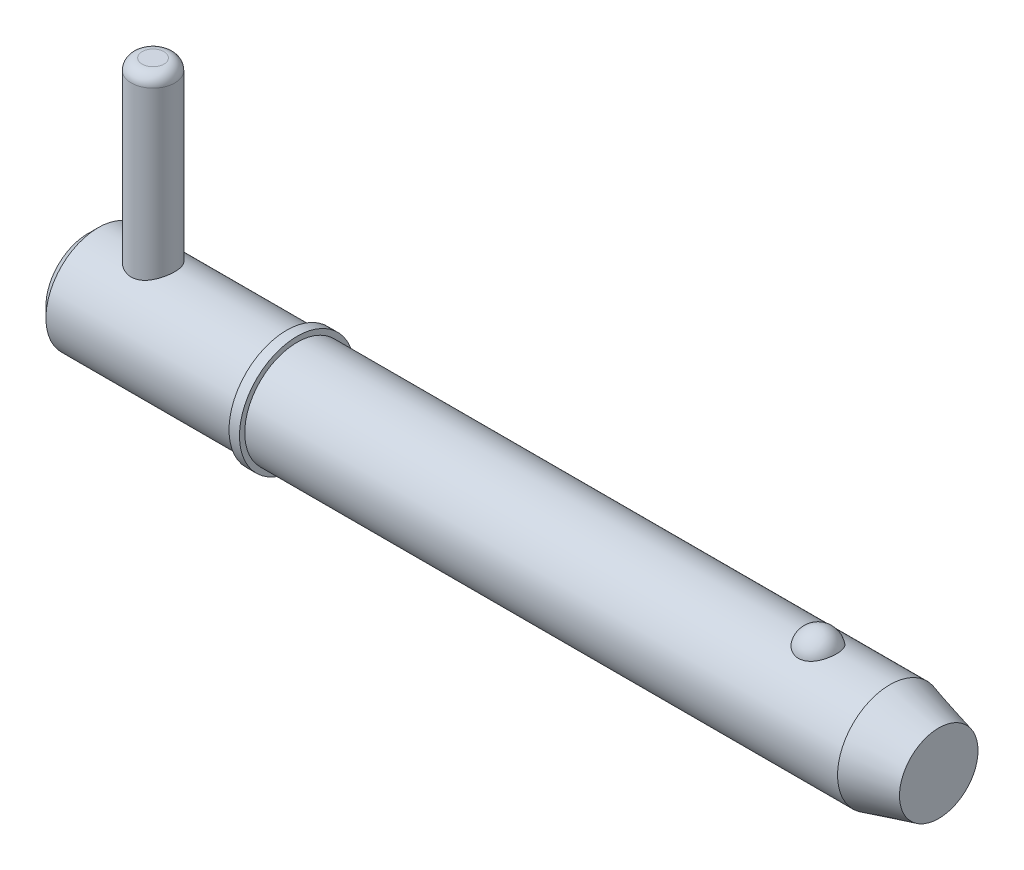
ISO-10303-21;
HEADER;
FILE_DESCRIPTION(('STEP AP214'),'2;1');
FILE_NAME('part.step','',(''),(''),'','','');
FILE_SCHEMA(('AUTOMOTIVE_DESIGN { 1 0 10303 214 1 1 1 1 }'));
ENDSEC;
DATA;
#1=APPLICATION_CONTEXT('core data for automotive mechanical design processes');
#2=APPLICATION_PROTOCOL_DEFINITION('international standard','automotive_design',2000,#1);
#3=PRODUCT_CONTEXT('',#1,'mechanical');
#4=PRODUCT('Part','Part','',(#3));
#5=PRODUCT_RELATED_PRODUCT_CATEGORY('part','',(#4));
#6=PRODUCT_DEFINITION_FORMATION('','',#4);
#7=PRODUCT_DEFINITION_CONTEXT('part definition',#1,'design');
#8=PRODUCT_DEFINITION('design','',#6,#7);
#9=PRODUCT_DEFINITION_SHAPE('','',#8);
#10=(LENGTH_UNIT() NAMED_UNIT(*) SI_UNIT(.MILLI.,.METRE.));
#11=(NAMED_UNIT(*) PLANE_ANGLE_UNIT() SI_UNIT($,.RADIAN.));
#12=(NAMED_UNIT(*) SI_UNIT($,.STERADIAN.) SOLID_ANGLE_UNIT());
#13=UNCERTAINTY_MEASURE_WITH_UNIT(LENGTH_MEASURE(1.E-05),#10,'distance_accuracy_value','');
#14=(GEOMETRIC_REPRESENTATION_CONTEXT(3) GLOBAL_UNCERTAINTY_ASSIGNED_CONTEXT((#13)) GLOBAL_UNIT_ASSIGNED_CONTEXT((#10,
#11,#12)) REPRESENTATION_CONTEXT('',''));
#15=CARTESIAN_POINT('',(0.,0.,0.));
#16=DIRECTION('',(0.,0.,1.));
#17=DIRECTION('',(1.,0.,0.));
#18=AXIS2_PLACEMENT_3D('',#15,#16,#17);
#19=CARTESIAN_POINT('',(5.94,20.635,0.));
#20=DIRECTION('',(0.,-1.,0.));
#21=DIRECTION('',(0.,0.,-1.));
#22=AXIS2_PLACEMENT_3D('',#19,#20,#21);
#23=CYLINDRICAL_SURFACE('',#22,1.98);
#24=CARTESIAN_POINT('',(5.94,-3.775,0.));
#25=DIRECTION('',(0.,1.,0.));
#26=DIRECTION('',(0.,0.,1.));
#27=AXIS2_PLACEMENT_3D('',#24,#25,#26);
#28=CIRCLE('',#27,1.98);
#29=CARTESIAN_POINT('',(5.94,-3.775,1.98));
#30=VERTEX_POINT('',#29);
#31=EDGE_CURVE('P0_E25',#30,#30,#28,.T.);
#32=ORIENTED_EDGE('',*,*,#31,.T.);
#33=EDGE_LOOP('',(#32));
#34=FACE_BOUND('',#33,.T.);
#35=CARTESIAN_POINT('',(5.94,19.645,0.));
#36=DIRECTION('',(0.,1.,0.));
#37=DIRECTION('',(0.,0.,1.));
#38=AXIS2_PLACEMENT_3D('',#35,#36,#37);
#39=CIRCLE('',#38,1.98);
#40=CARTESIAN_POINT('',(5.94,19.645,1.98));
#41=VERTEX_POINT('',#40);
#42=EDGE_CURVE('P0_E29',#41,#41,#39,.F.);
#43=ORIENTED_EDGE('',*,*,#42,.T.);
#44=EDGE_LOOP('',(#43));
#45=FACE_BOUND('',#44,.T.);
#46=ADVANCED_FACE('P0_F14',(#34,#45),#23,.T.);
#47=CARTESIAN_POINT('',(5.94,20.635,0.));
#48=DIRECTION('',(0.,1.,0.));
#49=DIRECTION('',(0.,0.,1.));
#50=AXIS2_PLACEMENT_3D('',#47,#48,#49);
#51=PLANE('',#50);
#52=CARTESIAN_POINT('',(5.94,20.635,0.));
#53=DIRECTION('',(0.,1.,0.));
#54=DIRECTION('',(0.,0.,1.));
#55=AXIS2_PLACEMENT_3D('',#52,#53,#54);
#56=CIRCLE('',#55,0.99);
#57=CARTESIAN_POINT('',(5.94,20.635,0.99));
#58=VERTEX_POINT('',#57);
#59=EDGE_CURVE('P0_E10',#58,#58,#56,.T.);
#60=ORIENTED_EDGE('',*,*,#59,.T.);
#61=EDGE_LOOP('',(#60));
#62=FACE_BOUND('',#61,.T.);
#63=ADVANCED_FACE('P0_F46',(#62),#51,.T.);
#64=CARTESIAN_POINT('',(5.94,-4.765,0.));
#65=DIRECTION('',(0.,1.,0.));
#66=DIRECTION('',(0.,0.,1.));
#67=AXIS2_PLACEMENT_3D('',#64,#65,#66);
#68=PLANE('',#67);
#69=CARTESIAN_POINT('',(5.94,-4.765,0.));
#70=DIRECTION('',(0.,1.,0.));
#71=DIRECTION('',(0.,0.,1.));
#72=AXIS2_PLACEMENT_3D('',#69,#70,#71);
#73=CIRCLE('',#72,0.99);
#74=CARTESIAN_POINT('',(5.94,-4.765,0.99));
#75=VERTEX_POINT('',#74);
#76=EDGE_CURVE('P0_E21',#75,#75,#73,.F.);
#77=ORIENTED_EDGE('',*,*,#76,.T.);
#78=EDGE_LOOP('',(#77));
#79=FACE_BOUND('',#78,.T.);
#80=ADVANCED_FACE('P0_F43',(#79),#68,.F.);
#81=CARTESIAN_POINT('',(5.94,-3.775,0.));
#82=DIRECTION('',(0.,1.,0.));
#83=DIRECTION('',(0.,0.,1.));
#84=AXIS2_PLACEMENT_3D('',#81,#82,#83);
#85=DEGENERATE_TOROIDAL_SURFACE('',#84,0.99,0.99,.T.);
#86=ORIENTED_EDGE('',*,*,#76,.F.);
#87=EDGE_LOOP('',(#86));
#88=FACE_BOUND('',#87,.T.);
#89=ORIENTED_EDGE('',*,*,#31,.F.);
#90=EDGE_LOOP('',(#89));
#91=FACE_BOUND('',#90,.T.);
#92=ADVANCED_FACE('P0_F38',(#88,#91),#85,.T.);
#93=CARTESIAN_POINT('',(5.94,19.645,0.));
#94=DIRECTION('',(0.,1.,0.));
#95=DIRECTION('',(0.,0.,1.));
#96=AXIS2_PLACEMENT_3D('',#93,#94,#95);
#97=DEGENERATE_TOROIDAL_SURFACE('',#96,0.99,0.99,.T.);
#98=ORIENTED_EDGE('',*,*,#42,.F.);
#99=EDGE_LOOP('',(#98));
#100=FACE_BOUND('',#99,.T.);
#101=ORIENTED_EDGE('',*,*,#59,.F.);
#102=EDGE_LOOP('',(#101));
#103=FACE_BOUND('',#102,.T.);
#104=ADVANCED_FACE('P0_F16',(#100,#103),#97,.T.);
#105=CLOSED_SHELL('',(#46,#63,#80,#92,#104));
#106=MANIFOLD_SOLID_BREP('P0_B1',#105);
#107=CARTESIAN_POINT('',(0.,0.,0.));
#108=DIRECTION('',(1.,0.,0.));
#109=DIRECTION('',(0.,0.,-1.));
#110=AXIS2_PLACEMENT_3D('',#107,#108,#109);
#111=CYLINDRICAL_SURFACE('',#110,4.765);
#112=CARTESIAN_POINT('',(73.0241944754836,0.,0.));
#113=DIRECTION('',(1.,0.,0.));
#114=DIRECTION('',(0.,0.,-1.));
#115=AXIS2_PLACEMENT_3D('',#112,#113,#114);
#116=CIRCLE('',#115,4.765);
#117=CARTESIAN_POINT('',(73.0241944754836,0.,-4.765));
#118=VERTEX_POINT('',#117);
#119=EDGE_CURVE('P1_E81',#118,#118,#116,.T.);
#120=ORIENTED_EDGE('',*,*,#119,.F.);
#121=EDGE_LOOP('',(#120));
#122=FACE_BOUND('',#121,.T.);
#123=CARTESIAN_POINT('',(19.05,0.,0.));
#124=DIRECTION('',(1.,0.,0.));
#125=DIRECTION('',(0.,0.,-1.));
#126=AXIS2_PLACEMENT_3D('',#123,#124,#125);
#127=CIRCLE('',#126,4.765);
#128=CARTESIAN_POINT('',(19.05,0.,-4.765));
#129=VERTEX_POINT('',#128);
#130=EDGE_CURVE('P1_E85',#129,#129,#127,.T.);
#131=ORIENTED_EDGE('',*,*,#130,.T.);
#132=EDGE_LOOP('',(#131));
#133=FACE_BOUND('',#132,.T.);
#134=CARTESIAN_POINT('',(66.471020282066,4.42764777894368,1.76101111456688));
#135=CARTESIAN_POINT('',(66.3797212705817,4.42764470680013,1.76101422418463));
#136=CARTESIAN_POINT('',(66.2884468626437,4.43059091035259,1.75366340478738));
#137=CARTESIAN_POINT('',(66.108615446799,4.44201846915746,1.72451180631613));
#138=CARTESIAN_POINT('',(66.0200577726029,4.45049845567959,1.70271460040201));
#139=CARTESIAN_POINT('',(65.8482570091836,4.47200516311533,1.6453937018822));
#140=CARTESIAN_POINT('',(65.7650064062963,4.48502527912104,1.60988994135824));
#141=CARTESIAN_POINT('',(65.6057633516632,4.51419542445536,1.52617873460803));
#142=CARTESIAN_POINT('',(65.5297723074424,4.53034605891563,1.47796883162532));
#143=CARTESIAN_POINT('',(65.3847445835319,4.5645931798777,1.36860494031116));
#144=CARTESIAN_POINT('',(65.3159645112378,4.58273170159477,1.30712420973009));
#145=CARTESIAN_POINT('',(65.1893423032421,4.61870302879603,1.1737020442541));
#146=CARTESIAN_POINT('',(65.1315021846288,4.63653577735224,1.1017586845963));
#147=CARTESIAN_POINT('',(65.0255709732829,4.67090140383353,0.945806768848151));
#148=CARTESIAN_POINT('',(64.9780305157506,4.68734068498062,0.861402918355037));
#149=CARTESIAN_POINT('',(64.8970817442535,4.71628466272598,0.685442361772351));
#150=CARTESIAN_POINT('',(64.8636747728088,4.72878898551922,0.593884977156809));
#151=CARTESIAN_POINT('',(64.811287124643,4.74874061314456,0.404781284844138));
#152=CARTESIAN_POINT('',(64.7925178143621,4.75611366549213,0.30716844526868));
#153=CARTESIAN_POINT('',(64.7705846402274,4.76475393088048,0.109940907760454));
#154=CARTESIAN_POINT('',(64.7674205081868,4.76602124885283,0.0103262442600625));
#155=CARTESIAN_POINT('',(64.7767405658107,4.76232928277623,-0.187629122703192));
#156=CARTESIAN_POINT('',(64.7891588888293,4.7573962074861,-0.285973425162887));
#157=CARTESIAN_POINT('',(64.8292804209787,4.74184975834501,-0.47902728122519));
#158=CARTESIAN_POINT('',(64.8569839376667,4.7312362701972,-0.573736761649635));
#159=CARTESIAN_POINT('',(64.9271581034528,4.70540026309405,-0.756973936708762));
#160=CARTESIAN_POINT('',(64.9696460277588,4.69017235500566,-0.845494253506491));
#161=CARTESIAN_POINT('',(65.068520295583,4.6566986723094,-1.01378033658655));
#162=CARTESIAN_POINT('',(65.1249076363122,4.63845268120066,-1.09354547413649));
#163=CARTESIAN_POINT('',(65.250552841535,4.60085438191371,-1.24228523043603));
#164=CARTESIAN_POINT('',(65.3198439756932,4.58149930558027,-1.31123108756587));
#165=CARTESIAN_POINT('',(65.4696066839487,4.54391653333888,-1.43607409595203));
#166=CARTESIAN_POINT('',(65.5500771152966,4.52568872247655,-1.49197257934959));
#167=CARTESIAN_POINT('',(65.7181500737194,4.49293007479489,-1.58786764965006));
#168=CARTESIAN_POINT('',(65.8055445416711,4.47832346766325,-1.62820219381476));
#169=CARTESIAN_POINT('',(65.9865534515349,4.45406011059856,-1.69345757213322));
#170=CARTESIAN_POINT('',(66.0801655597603,4.44440151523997,-1.71838415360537));
#171=CARTESIAN_POINT('',(66.2658939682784,4.43159888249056,-1.75112843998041));
#172=CARTESIAN_POINT('',(66.357849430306,4.42815213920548,-1.75974223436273));
#173=CARTESIAN_POINT('',(66.5419658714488,4.427247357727,-1.76201865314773));
#174=CARTESIAN_POINT('',(66.6341268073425,4.42978816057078,-1.7556841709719));
#175=CARTESIAN_POINT('',(66.8131292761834,4.4403864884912,-1.72869560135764));
#176=CARTESIAN_POINT('',(66.9000474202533,4.44827555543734,-1.70847853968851));
#177=CARTESIAN_POINT('',(67.0691314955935,4.46852246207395,-1.65479562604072));
#178=CARTESIAN_POINT('',(67.1512970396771,4.48088066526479,-1.62132869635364));
#179=CARTESIAN_POINT('',(67.3105916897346,4.50907357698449,-1.54120560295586));
#180=CARTESIAN_POINT('',(67.3875700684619,4.52497884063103,-1.49427526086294));
#181=CARTESIAN_POINT('',(67.5327080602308,4.55845148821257,-1.38881222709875));
#182=CARTESIAN_POINT('',(67.6008656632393,4.57601924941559,-1.33027689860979));
#183=CARTESIAN_POINT('',(67.7300990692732,4.61196537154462,-1.19991049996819));
#184=CARTESIAN_POINT('',(67.7906562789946,4.63034074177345,-1.12756415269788));
#185=CARTESIAN_POINT('',(67.8992797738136,4.66513959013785,-0.973612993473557));
#186=CARTESIAN_POINT('',(67.9473438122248,4.68156271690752,-0.892006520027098));
#187=CARTESIAN_POINT('',(68.031383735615,4.71130224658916,-0.718892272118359));
#188=CARTESIAN_POINT('',(68.0669185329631,4.724501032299,-0.627149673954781));
#189=CARTESIAN_POINT('',(68.1229522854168,4.74571823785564,-0.438611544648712));
#190=CARTESIAN_POINT('',(68.143450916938,4.75373654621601,-0.341815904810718));
#191=CARTESIAN_POINT('',(68.1690338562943,4.76378905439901,-0.145633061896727));
#192=CARTESIAN_POINT('',(68.174076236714,4.76580697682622,-0.0462395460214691));
#193=CARTESIAN_POINT('',(68.1685239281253,4.76360573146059,0.152038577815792));
#194=CARTESIAN_POINT('',(68.1579294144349,4.75938663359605,0.250923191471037));
#195=CARTESIAN_POINT('',(68.1213875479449,4.74516937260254,0.445004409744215));
#196=CARTESIAN_POINT('',(68.0954964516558,4.73519238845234,0.54021317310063));
#197=CARTESIAN_POINT('',(68.0289273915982,4.7104939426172,0.724662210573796));
#198=CARTESIAN_POINT('',(67.988248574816,4.69577220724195,0.81390214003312));
#199=CARTESIAN_POINT('',(67.8927177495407,4.66303767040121,0.984313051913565));
#200=CARTESIAN_POINT('',(67.8378042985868,4.64501070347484,1.06544688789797));
#201=CARTESIAN_POINT('',(67.7150496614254,4.60764678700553,1.21692673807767));
#202=CARTESIAN_POINT('',(67.6472086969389,4.58830985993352,1.2872729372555));
#203=CARTESIAN_POINT('',(67.5005480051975,4.55060370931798,1.41479271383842));
#204=CARTESIAN_POINT('',(67.4217918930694,4.53222967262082,1.47203785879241));
#205=CARTESIAN_POINT('',(67.2549890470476,4.49849576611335,1.57212016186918));
#206=CARTESIAN_POINT('',(67.1669417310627,4.48313608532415,1.61495641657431));
#207=CARTESIAN_POINT('',(66.9797918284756,4.45676184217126,1.68642657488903));
#208=CARTESIAN_POINT('',(66.8803653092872,4.44598302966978,1.71430590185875));
#209=CARTESIAN_POINT('',(66.6776210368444,4.43142918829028,1.75159258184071));
#210=CARTESIAN_POINT('',(66.5743049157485,4.42765125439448,1.76100759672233));
#211=CARTESIAN_POINT('',(66.471020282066,4.42764777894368,1.76101111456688));
#212=B_SPLINE_CURVE_WITH_KNOTS('',3,(#134,#135,#136,#137,#138,#139,#140,#141,#142,#143,#144,
#145,#146,#147,#148,#149,#150,#151,#152,#153,#154,#155,#156,#157,#158,#159,#160,#161,#162,#163,
#164,#165,#166,#167,#168,#169,#170,#171,#172,#173,#174,#175,#176,#177,#178,#179,#180,#181,#182,
#183,#184,#185,#186,#187,#188,#189,#190,#191,#192,#193,#194,#195,#196,#197,#198,#199,#200,#201,
#202,#203,#204,#205,#206,#207,#208,#209,#210,#211),.UNSPECIFIED.,.T.,.F.,(4,2,2,2,2,2,2,2,2,2,2,
2,2,2,2,2,2,2,2,2,2,2,2,2,2,2,2,2,2,2,2,2,2,2,2,2,2,2,4),(0.,0.273517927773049,
0.546968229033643,0.820022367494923,1.09312934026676,1.37393946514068,1.65480131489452,
1.94820420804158,2.24163496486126,2.53922817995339,2.83681628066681,3.13315071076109,
3.42949110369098,3.72617893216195,4.02288805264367,4.32037303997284,4.61782764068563,
4.9084009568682,5.19886582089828,5.4747485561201,5.75057789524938,6.01809977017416,
6.2856434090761,6.55907787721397,6.83257454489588,7.11962987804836,7.40673679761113,
7.70312663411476,7.99952284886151,8.29672237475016,8.59391856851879,8.89002850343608,
9.18615552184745,9.483582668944,9.78100471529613,10.0767610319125,10.3725358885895,
10.6820893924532,10.991514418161),.UNSPECIFIED.);
#213=CARTESIAN_POINT('',(66.471020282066,4.42764777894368,1.76101111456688));
#214=VERTEX_POINT('',#213);
#215=EDGE_CURVE('P1_E35',#214,#214,#212,.T.);
#216=ORIENTED_EDGE('',*,*,#215,.T.);
#217=EDGE_LOOP('',(#216));
#218=FACE_BOUND('',#217,.T.);
#219=ADVANCED_FACE('P1_F13',(#122,#133,#218),#111,.T.);
#220=CARTESIAN_POINT('',(0.,0.,0.));
#221=DIRECTION('',(-1.,0.,0.));
#222=DIRECTION('',(0.,0.,1.));
#223=AXIS2_PLACEMENT_3D('',#220,#221,#222);
#224=PLANE('',#223);
#225=CARTESIAN_POINT('',(0.,0.,0.));
#226=DIRECTION('',(1.,0.,0.));
#227=DIRECTION('',(0.,0.,-1.));
#228=AXIS2_PLACEMENT_3D('',#225,#226,#227);
#229=CIRCLE('',#228,3.812);
#230=CARTESIAN_POINT('',(0.,0.,-3.812));
#231=VERTEX_POINT('',#230);
#232=EDGE_CURVE('P1_E9',#231,#231,#229,.T.);
#233=ORIENTED_EDGE('',*,*,#232,.F.);
#234=EDGE_LOOP('',(#233));
#235=FACE_BOUND('',#234,.T.);
#236=ADVANCED_FACE('P1_F15',(#235),#224,.T.);
#237=CARTESIAN_POINT('',(0.952999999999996,0.,0.));
#238=DIRECTION('',(1.,0.,0.));
#239=DIRECTION('',(0.,0.,-1.));
#240=AXIS2_PLACEMENT_3D('',#237,#238,#239);
#241=CONICAL_SURFACE('',#240,4.765,0.78539816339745);
#242=ORIENTED_EDGE('',*,*,#232,.T.);
#243=EDGE_LOOP('',(#242));
#244=FACE_BOUND('',#243,.T.);
#245=CARTESIAN_POINT('',(0.952999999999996,0.,0.));
#246=DIRECTION('',(1.,0.,0.));
#247=DIRECTION('',(0.,0.,-1.));
#248=AXIS2_PLACEMENT_3D('',#245,#246,#247);
#249=CIRCLE('',#248,4.765);
#250=CARTESIAN_POINT('',(0.952999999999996,0.,-4.765));
#251=VERTEX_POINT('',#250);
#252=EDGE_CURVE('P1_E26',#251,#251,#249,.T.);
#253=ORIENTED_EDGE('',*,*,#252,.F.);
#254=EDGE_LOOP('',(#253));
#255=FACE_BOUND('',#254,.T.);
#256=ADVANCED_FACE('P1_F77',(#244,#255),#241,.T.);
#257=CARTESIAN_POINT('',(0.,0.,0.));
#258=DIRECTION('',(1.,0.,0.));
#259=DIRECTION('',(0.,0.,-1.));
#260=AXIS2_PLACEMENT_3D('',#257,#258,#259);
#261=CYLINDRICAL_SURFACE('',#260,4.765);
#262=CARTESIAN_POINT('',(5.94,-4.33414639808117,1.98));
#263=CARTESIAN_POINT('',(5.83435484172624,-4.33415447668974,1.97999169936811));
#264=CARTESIAN_POINT('',(5.72854887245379,-4.33806396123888,1.97149330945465));
#265=CARTESIAN_POINT('',(5.51998191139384,-4.35319906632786,1.93783487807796));
#266=CARTESIAN_POINT('',(5.41723000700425,-4.3644446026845,1.91262947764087));
#267=CARTESIAN_POINT('',(5.21817294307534,-4.39274225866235,1.84670269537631));
#268=CARTESIAN_POINT('',(5.12184344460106,-4.40977076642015,1.80604432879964));
#269=CARTESIAN_POINT('',(4.93740039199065,-4.44768106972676,1.71055160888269));
#270=CARTESIAN_POINT('',(4.84928487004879,-4.46856193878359,1.65572066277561));
#271=CARTESIAN_POINT('',(4.67826533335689,-4.51326966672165,1.52981120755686));
#272=CARTESIAN_POINT('',(4.59593118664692,-4.53719608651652,1.45799365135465));
#273=CARTESIAN_POINT('',(4.44405452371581,-4.58448035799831,1.30170177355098));
#274=CARTESIAN_POINT('',(4.37451692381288,-4.60783798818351,1.21722260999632));
#275=CARTESIAN_POINT('',(4.24730683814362,-4.65256187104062,1.03353484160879));
#276=CARTESIAN_POINT('',(4.19027484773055,-4.67379892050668,0.933848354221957));
#277=CARTESIAN_POINT('',(4.0940363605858,-4.7106711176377,0.7252544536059));
#278=CARTESIAN_POINT('',(4.05482199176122,-4.72630873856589,0.61635113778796));
#279=CARTESIAN_POINT('',(3.99739515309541,-4.74951416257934,0.398397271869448));
#280=CARTESIAN_POINT('',(3.97820018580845,-4.7574579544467,0.289646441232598));
#281=CARTESIAN_POINT('',(3.95818309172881,-4.76574596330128,0.0701967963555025));
#282=CARTESIAN_POINT('',(3.95735355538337,-4.76609324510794,-0.0405012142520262));
#283=CARTESIAN_POINT('',(3.9735743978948,-4.75937098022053,-0.253561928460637));
#284=CARTESIAN_POINT('',(3.98954548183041,-4.75274912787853,-0.356023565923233));
#285=CARTESIAN_POINT('',(4.03706504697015,-4.73344665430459,-0.556659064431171));
#286=CARTESIAN_POINT('',(4.06861467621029,-4.72076558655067,-0.654832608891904));
#287=CARTESIAN_POINT('',(4.14677192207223,-4.69032846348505,-0.845904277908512));
#288=CARTESIAN_POINT('',(4.19360181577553,-4.67249797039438,-0.938699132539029));
#289=CARTESIAN_POINT('',(4.30077315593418,-4.63350852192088,-1.11535616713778));
#290=CARTESIAN_POINT('',(4.3611193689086,-4.61234839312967,-1.19921518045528));
#291=CARTESIAN_POINT('',(4.49853487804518,-4.56707259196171,-1.3618711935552));
#292=CARTESIAN_POINT('',(4.57648039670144,-4.5428537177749,-1.43990029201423));
#293=CARTESIAN_POINT('',(4.74440779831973,-4.49530722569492,-1.58211009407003));
#294=CARTESIAN_POINT('',(4.83439425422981,-4.47197995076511,-1.64628551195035));
#295=CARTESIAN_POINT('',(5.02755026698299,-4.42812342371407,-1.76092221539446));
#296=CARTESIAN_POINT('',(5.13105348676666,-4.40770990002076,-1.81086937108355));
#297=CARTESIAN_POINT('',(5.34607555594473,-4.37336901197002,-1.89231211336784));
#298=CARTESIAN_POINT('',(5.45758864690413,-4.3594370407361,-1.92382080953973));
#299=CARTESIAN_POINT('',(5.67777275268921,-4.34077746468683,-1.96554536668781));
#300=CARTESIAN_POINT('',(5.78616167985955,-4.33551319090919,-1.9770057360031));
#301=CARTESIAN_POINT('',(6.00341835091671,-4.33325118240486,-1.98196183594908));
#302=CARTESIAN_POINT('',(6.11228591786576,-4.33625061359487,-1.97546372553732));
#303=CARTESIAN_POINT('',(6.32012423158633,-4.34962383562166,-1.94582288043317));
#304=CARTESIAN_POINT('',(6.41928436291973,-4.35951709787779,-1.92376364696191));
#305=CARTESIAN_POINT('',(6.61241543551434,-4.38495043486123,-1.86506038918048));
#306=CARTESIAN_POINT('',(6.70638516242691,-4.40049182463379,-1.82841296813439));
#307=CARTESIAN_POINT('',(6.89090272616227,-4.43627016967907,-1.73985559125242));
#308=CARTESIAN_POINT('',(6.98113841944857,-4.45667771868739,-1.68736639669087));
#309=CARTESIAN_POINT('',(7.1519532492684,-4.49964530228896,-1.56919282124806));
#310=CARTESIAN_POINT('',(7.232528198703,-4.52220626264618,-1.50350275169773));
#311=CARTESIAN_POINT('',(7.38851617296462,-4.56914071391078,-1.35452895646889));
#312=CARTESIAN_POINT('',(7.46298462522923,-4.5935132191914,-1.27025197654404));
#313=CARTESIAN_POINT('',(7.59689029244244,-4.63962841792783,-1.08983181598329));
#314=CARTESIAN_POINT('',(7.65632644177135,-4.66137092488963,-0.993687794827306));
#315=CARTESIAN_POINT('',(7.75840361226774,-4.69991192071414,-0.791608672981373));
#316=CARTESIAN_POINT('',(7.80100481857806,-4.71669866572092,-0.685651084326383));
#317=CARTESIAN_POINT('',(7.86746997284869,-4.74331408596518,-0.467197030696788));
#318=CARTESIAN_POINT('',(7.8913450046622,-4.75314687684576,-0.354704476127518));
#319=CARTESIAN_POINT('',(7.91828971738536,-4.76427543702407,-0.134819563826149));
#320=CARTESIAN_POINT('',(7.92269147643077,-4.76611762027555,-0.027616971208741));
#321=CARTESIAN_POINT('',(7.91414154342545,-4.76256684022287,0.185959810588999));
#322=CARTESIAN_POINT('',(7.90119286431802,-4.75717513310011,0.292334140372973));
#323=CARTESIAN_POINT('',(7.85926572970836,-4.74004856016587,0.497383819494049));
#324=CARTESIAN_POINT('',(7.83086647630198,-4.72854322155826,0.596198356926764));
#325=CARTESIAN_POINT('',(7.75947503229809,-4.70045111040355,0.787624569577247));
#326=CARTESIAN_POINT('',(7.71648006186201,-4.68386336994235,0.880235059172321));
#327=CARTESIAN_POINT('',(7.6149456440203,-4.64628321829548,1.06122875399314));
#328=CARTESIAN_POINT('',(7.55579211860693,-4.62512577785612,1.14923242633));
#329=CARTESIAN_POINT('',(7.42451813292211,-4.58091700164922,1.31443888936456));
#330=CARTESIAN_POINT('',(7.35239289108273,-4.5578649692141,1.39163767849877));
#331=CARTESIAN_POINT('',(7.19146107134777,-4.51050832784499,1.53847013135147));
#332=CARTESIAN_POINT('',(7.10185635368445,-4.48622440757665,1.60723941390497));
#333=CARTESIAN_POINT('',(6.91164948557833,-4.44076541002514,1.72888900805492));
#334=CARTESIAN_POINT('',(6.81104124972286,-4.41959206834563,1.78176046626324));
#335=CARTESIAN_POINT('',(6.60181953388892,-4.38318936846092,1.86953227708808));
#336=CARTESIAN_POINT('',(6.49325511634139,-4.3679267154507,1.90453365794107));
#337=CARTESIAN_POINT('',(6.32681512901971,-4.35102038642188,1.94268459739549));
#338=CARTESIAN_POINT('',(6.27079191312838,-4.34638447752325,1.953006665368));
#339=CARTESIAN_POINT('',(6.15793999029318,-4.33925923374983,1.96879053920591));
#340=CARTESIAN_POINT('',(6.10111188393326,-4.33676837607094,1.97425579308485));
#341=CARTESIAN_POINT('',(6.00947316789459,-4.33456308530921,1.97908711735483));
#342=CARTESIAN_POINT('',(5.97474528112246,-4.33414374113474,1.98000272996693));
#343=CARTESIAN_POINT('',(5.94,-4.33414639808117,1.98));
#344=B_SPLINE_CURVE_WITH_KNOTS('',3,(#262,#263,#264,#265,#266,#267,#268,#269,#270,#271,#272,
#273,#274,#275,#276,#277,#278,#279,#280,#281,#282,#283,#284,#285,#286,#287,#288,#289,#290,#291,
#292,#293,#294,#295,#296,#297,#298,#299,#300,#301,#302,#303,#304,#305,#306,#307,#308,#309,#310,
#311,#312,#313,#314,#315,#316,#317,#318,#319,#320,#321,#322,#323,#324,#325,#326,#327,#328,#329,
#330,#331,#332,#333,#334,#335,#336,#337,#338,#339,#340,#341,#342,#343),.UNSPECIFIED.,.T.,.F.,(4,
2,2,2,2,2,2,2,2,2,2,2,2,2,2,2,2,2,2,2,2,2,2,2,2,2,2,2,2,2,2,2,2,2,2,2,2,2,2,2,4),(0.,
0.316814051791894,0.634491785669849,0.950887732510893,1.2672076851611,1.60127705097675,
1.93547449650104,2.28407463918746,2.63252061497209,2.96292077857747,3.29318763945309,
3.60346227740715,3.91375978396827,4.22878888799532,4.54392926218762,4.88117914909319,
5.21855748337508,5.56691259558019,5.91501972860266,6.24062939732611,6.56612741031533,
6.87094948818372,7.17584258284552,7.49361276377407,7.81152017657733,8.15513975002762,
8.4987836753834,8.8432355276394,9.18748334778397,9.50777781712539,9.8280166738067,
10.1370037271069,10.4460496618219,10.7690461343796,11.0921619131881,11.4371238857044,
11.7822776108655,12.1254577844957,12.2967183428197,12.4678572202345,12.5720531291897),.UNSPECIFIED.);
#345=CARTESIAN_POINT('',(5.94,-4.33414639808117,1.98));
#346=VERTEX_POINT('',#345);
#347=EDGE_CURVE('P1_E17',#346,#346,#344,.T.);
#348=ORIENTED_EDGE('',*,*,#347,.F.);
#349=EDGE_LOOP('',(#348));
#350=FACE_BOUND('',#349,.T.);
#351=CARTESIAN_POINT('',(5.94,4.33414639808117,1.98));
#352=CARTESIAN_POINT('',(6.04564515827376,4.33415447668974,1.97999169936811));
#353=CARTESIAN_POINT('',(6.15145112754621,4.33806396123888,1.97149330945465));
#354=CARTESIAN_POINT('',(6.36001808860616,4.35319906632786,1.93783487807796));
#355=CARTESIAN_POINT('',(6.46276999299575,4.3644446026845,1.91262947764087));
#356=CARTESIAN_POINT('',(6.66182705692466,4.39274225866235,1.84670269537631));
#357=CARTESIAN_POINT('',(6.75815655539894,4.40977076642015,1.80604432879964));
#358=CARTESIAN_POINT('',(6.94259960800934,4.44768106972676,1.71055160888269));
#359=CARTESIAN_POINT('',(7.03071512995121,4.46856193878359,1.65572066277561));
#360=CARTESIAN_POINT('',(7.20173466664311,4.51326966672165,1.52981120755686));
#361=CARTESIAN_POINT('',(7.28406881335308,4.53719608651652,1.45799365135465));
#362=CARTESIAN_POINT('',(7.43594547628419,4.58448035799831,1.30170177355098));
#363=CARTESIAN_POINT('',(7.50548307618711,4.60783798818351,1.21722260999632));
#364=CARTESIAN_POINT('',(7.63269316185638,4.65256187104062,1.03353484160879));
#365=CARTESIAN_POINT('',(7.68972515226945,4.67379892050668,0.933848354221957));
#366=CARTESIAN_POINT('',(7.7859636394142,4.7106711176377,0.7252544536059));
#367=CARTESIAN_POINT('',(7.82517800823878,4.72630873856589,0.61635113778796));
#368=CARTESIAN_POINT('',(7.88260484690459,4.74951416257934,0.398397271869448));
#369=CARTESIAN_POINT('',(7.90179981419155,4.7574579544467,0.289646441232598));
#370=CARTESIAN_POINT('',(7.92181690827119,4.76574596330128,0.0701967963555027));
#371=CARTESIAN_POINT('',(7.92264644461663,4.76609324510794,-0.040501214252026));
#372=CARTESIAN_POINT('',(7.9064256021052,4.75937098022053,-0.253561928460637));
#373=CARTESIAN_POINT('',(7.89045451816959,4.75274912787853,-0.356023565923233));
#374=CARTESIAN_POINT('',(7.84293495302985,4.73344665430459,-0.55665906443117));
#375=CARTESIAN_POINT('',(7.81138532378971,4.72076558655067,-0.654832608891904));
#376=CARTESIAN_POINT('',(7.73322807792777,4.69032846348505,-0.845904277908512));
#377=CARTESIAN_POINT('',(7.68639818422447,4.67249797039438,-0.938699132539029));
#378=CARTESIAN_POINT('',(7.57922684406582,4.63350852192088,-1.11535616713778));
#379=CARTESIAN_POINT('',(7.5188806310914,4.61234839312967,-1.19921518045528));
#380=CARTESIAN_POINT('',(7.38146512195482,4.56707259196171,-1.3618711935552));
#381=CARTESIAN_POINT('',(7.30351960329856,4.5428537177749,-1.43990029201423));
#382=CARTESIAN_POINT('',(7.13559220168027,4.49530722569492,-1.58211009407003));
#383=CARTESIAN_POINT('',(7.04560574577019,4.47197995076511,-1.64628551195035));
#384=CARTESIAN_POINT('',(6.85244973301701,4.42812342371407,-1.76092221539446));
#385=CARTESIAN_POINT('',(6.74894651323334,4.40770990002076,-1.81086937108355));
#386=CARTESIAN_POINT('',(6.53392444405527,4.37336901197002,-1.89231211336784));
#387=CARTESIAN_POINT('',(6.42241135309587,4.3594370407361,-1.92382080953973));
#388=CARTESIAN_POINT('',(6.20222724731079,4.34077746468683,-1.96554536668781));
#389=CARTESIAN_POINT('',(6.09383832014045,4.33551319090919,-1.9770057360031));
#390=CARTESIAN_POINT('',(5.87658164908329,4.33325118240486,-1.98196183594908));
#391=CARTESIAN_POINT('',(5.76771408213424,4.33625061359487,-1.97546372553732));
#392=CARTESIAN_POINT('',(5.55987576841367,4.34962383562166,-1.94582288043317));
#393=CARTESIAN_POINT('',(5.46071563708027,4.35951709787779,-1.92376364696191));
#394=CARTESIAN_POINT('',(5.26758456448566,4.38495043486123,-1.86506038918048));
#395=CARTESIAN_POINT('',(5.17361483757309,4.40049182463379,-1.82841296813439));
#396=CARTESIAN_POINT('',(4.98909727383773,4.43627016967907,-1.73985559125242));
#397=CARTESIAN_POINT('',(4.89886158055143,4.45667771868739,-1.68736639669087));
#398=CARTESIAN_POINT('',(4.72804675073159,4.49964530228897,-1.56919282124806));
#399=CARTESIAN_POINT('',(4.647471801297,4.52220626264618,-1.50350275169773));
#400=CARTESIAN_POINT('',(4.49148382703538,4.56914071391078,-1.35452895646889));
#401=CARTESIAN_POINT('',(4.41701537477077,4.5935132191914,-1.27025197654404));
#402=CARTESIAN_POINT('',(4.28310970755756,4.63962841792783,-1.08983181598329));
#403=CARTESIAN_POINT('',(4.22367355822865,4.66137092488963,-0.993687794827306));
#404=CARTESIAN_POINT('',(4.12159638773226,4.69991192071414,-0.791608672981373));
#405=CARTESIAN_POINT('',(4.07899518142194,4.71669866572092,-0.685651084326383));
#406=CARTESIAN_POINT('',(4.01253002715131,4.74331408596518,-0.467197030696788));
#407=CARTESIAN_POINT('',(3.98865499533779,4.75314687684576,-0.354704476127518));
#408=CARTESIAN_POINT('',(3.96171028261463,4.76427543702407,-0.134819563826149));
#409=CARTESIAN_POINT('',(3.95730852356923,4.76611762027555,-0.0276169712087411));
#410=CARTESIAN_POINT('',(3.96585845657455,4.76256684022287,0.185959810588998));
#411=CARTESIAN_POINT('',(3.97880713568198,4.75717513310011,0.292334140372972));
#412=CARTESIAN_POINT('',(4.02073427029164,4.74004856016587,0.497383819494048));
#413=CARTESIAN_POINT('',(4.04913352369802,4.72854322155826,0.596198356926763));
#414=CARTESIAN_POINT('',(4.12052496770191,4.70045111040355,0.787624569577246));
#415=CARTESIAN_POINT('',(4.16351993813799,4.68386336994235,0.880235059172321));
#416=CARTESIAN_POINT('',(4.2650543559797,4.64628321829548,1.06122875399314));
#417=CARTESIAN_POINT('',(4.32420788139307,4.62512577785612,1.14923242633));
#418=CARTESIAN_POINT('',(4.45548186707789,4.58091700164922,1.31443888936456));
#419=CARTESIAN_POINT('',(4.52760710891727,4.5578649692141,1.39163767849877));
#420=CARTESIAN_POINT('',(4.68853892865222,4.51050832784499,1.53847013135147));
#421=CARTESIAN_POINT('',(4.77814364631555,4.48622440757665,1.60723941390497));
#422=CARTESIAN_POINT('',(4.96835051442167,4.44076541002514,1.72888900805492));
#423=CARTESIAN_POINT('',(5.06895875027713,4.41959206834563,1.78176046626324));
#424=CARTESIAN_POINT('',(5.27818046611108,4.38318936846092,1.86953227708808));
#425=CARTESIAN_POINT('',(5.38674488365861,4.3679267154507,1.90453365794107));
#426=CARTESIAN_POINT('',(5.55318487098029,4.35102038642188,1.94268459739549));
#427=CARTESIAN_POINT('',(5.60920808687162,4.34638447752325,1.953006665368));
#428=CARTESIAN_POINT('',(5.72206000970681,4.33925923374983,1.96879053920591));
#429=CARTESIAN_POINT('',(5.77888811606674,4.33676837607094,1.97425579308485));
#430=CARTESIAN_POINT('',(5.87052683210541,4.33456308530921,1.97908711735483));
#431=CARTESIAN_POINT('',(5.90525471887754,4.33414374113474,1.98000272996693));
#432=CARTESIAN_POINT('',(5.94,4.33414639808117,1.98));
#433=B_SPLINE_CURVE_WITH_KNOTS('',3,(#351,#352,#353,#354,#355,#356,#357,#358,#359,#360,#361,
#362,#363,#364,#365,#366,#367,#368,#369,#370,#371,#372,#373,#374,#375,#376,#377,#378,#379,#380,
#381,#382,#383,#384,#385,#386,#387,#388,#389,#390,#391,#392,#393,#394,#395,#396,#397,#398,#399,
#400,#401,#402,#403,#404,#405,#406,#407,#408,#409,#410,#411,#412,#413,#414,#415,#416,#417,#418,
#419,#420,#421,#422,#423,#424,#425,#426,#427,#428,#429,#430,#431,#432),.UNSPECIFIED.,.T.,.F.,(4,
2,2,2,2,2,2,2,2,2,2,2,2,2,2,2,2,2,2,2,2,2,2,2,2,2,2,2,2,2,2,2,2,2,2,2,2,2,2,2,4),(0.,
0.316814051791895,0.634491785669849,0.950887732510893,1.2672076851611,1.60127705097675,
1.93547449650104,2.28407463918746,2.63252061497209,2.96292077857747,3.29318763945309,
3.60346227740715,3.91375978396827,4.22878888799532,4.54392926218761,4.88117914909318,
5.21855748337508,5.56691259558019,5.91501972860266,6.24062939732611,6.56612741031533,
6.87094948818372,7.17584258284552,7.49361276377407,7.81152017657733,8.15513975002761,
8.4987836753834,8.84323552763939,9.18748334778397,9.50777781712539,9.8280166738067,
10.1370037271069,10.4460496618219,10.7690461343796,11.0921619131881,11.4371238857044,
11.7822776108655,12.1254577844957,12.2967183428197,12.4678572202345,12.5720531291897),.UNSPECIFIED.);
#434=CARTESIAN_POINT('',(5.94,4.33414639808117,1.98));
#435=VERTEX_POINT('',#434);
#436=EDGE_CURVE('P1_E43',#435,#435,#433,.T.);
#437=ORIENTED_EDGE('',*,*,#436,.F.);
#438=EDGE_LOOP('',(#437));
#439=FACE_BOUND('',#438,.T.);
#440=ORIENTED_EDGE('',*,*,#252,.T.);
#441=EDGE_LOOP('',(#440));
#442=FACE_BOUND('',#441,.T.);
#443=CARTESIAN_POINT('',(18.097,0.,0.));
#444=DIRECTION('',(1.,0.,0.));
#445=DIRECTION('',(0.,0.,-1.));
#446=AXIS2_PLACEMENT_3D('',#443,#444,#445);
#447=CIRCLE('',#446,4.765);
#448=CARTESIAN_POINT('',(18.097,0.,-4.765));
#449=VERTEX_POINT('',#448);
#450=EDGE_CURVE('P1_E31',#449,#449,#447,.T.);
#451=ORIENTED_EDGE('',*,*,#450,.F.);
#452=EDGE_LOOP('',(#451));
#453=FACE_BOUND('',#452,.T.);
#454=ADVANCED_FACE('P1_F103',(#350,#439,#442,#453),#261,.T.);
#455=CARTESIAN_POINT('',(18.097,4.765,0.));
#456=DIRECTION('',(-1.,0.,0.));
#457=DIRECTION('',(0.,0.,1.));
#458=AXIS2_PLACEMENT_3D('',#455,#456,#457);
#459=PLANE('',#458);
#460=ORIENTED_EDGE('',*,*,#450,.T.);
#461=EDGE_LOOP('',(#460));
#462=FACE_BOUND('',#461,.T.);
#463=CARTESIAN_POINT('',(18.097,0.,0.));
#464=DIRECTION('',(1.,0.,0.));
#465=DIRECTION('',(0.,0.,-1.));
#466=AXIS2_PLACEMENT_3D('',#463,#464,#465);
#467=CIRCLE('',#466,5.2415);
#468=CARTESIAN_POINT('',(18.097,0.,-5.2415));
#469=VERTEX_POINT('',#468);
#470=EDGE_CURVE('P1_E91',#469,#469,#467,.T.);
#471=ORIENTED_EDGE('',*,*,#470,.F.);
#472=EDGE_LOOP('',(#471));
#473=FACE_BOUND('',#472,.T.);
#474=ADVANCED_FACE('P1_F100',(#462,#473),#459,.T.);
#475=CARTESIAN_POINT('',(0.,0.,0.));
#476=DIRECTION('',(1.,0.,0.));
#477=DIRECTION('',(0.,0.,-1.));
#478=AXIS2_PLACEMENT_3D('',#475,#476,#477);
#479=CYLINDRICAL_SURFACE('',#478,5.2415);
#480=ORIENTED_EDGE('',*,*,#470,.T.);
#481=EDGE_LOOP('',(#480));
#482=FACE_BOUND('',#481,.T.);
#483=CARTESIAN_POINT('',(19.05,0.,0.));
#484=DIRECTION('',(1.,0.,0.));
#485=DIRECTION('',(0.,0.,-1.));
#486=AXIS2_PLACEMENT_3D('',#483,#484,#485);
#487=CIRCLE('',#486,5.2415);
#488=CARTESIAN_POINT('',(19.05,0.,-5.2415));
#489=VERTEX_POINT('',#488);
#490=EDGE_CURVE('P1_E88',#489,#489,#487,.T.);
#491=ORIENTED_EDGE('',*,*,#490,.F.);
#492=EDGE_LOOP('',(#491));
#493=FACE_BOUND('',#492,.T.);
#494=ADVANCED_FACE('P1_F68',(#482,#493),#479,.T.);
#495=CARTESIAN_POINT('',(19.05,5.2415,0.));
#496=DIRECTION('',(1.,0.,0.));
#497=DIRECTION('',(0.,0.,-1.));
#498=AXIS2_PLACEMENT_3D('',#495,#496,#497);
#499=PLANE('',#498);
#500=ORIENTED_EDGE('',*,*,#490,.T.);
#501=EDGE_LOOP('',(#500));
#502=FACE_BOUND('',#501,.T.);
#503=ORIENTED_EDGE('',*,*,#130,.F.);
#504=EDGE_LOOP('',(#503));
#505=FACE_BOUND('',#504,.T.);
#506=ADVANCED_FACE('P1_F62',(#502,#505),#499,.T.);
#507=CARTESIAN_POINT('',(77.47,0.,0.));
#508=DIRECTION('',(-1.,0.,0.));
#509=DIRECTION('',(0.,0.,1.));
#510=AXIS2_PLACEMENT_3D('',#507,#508,#509);
#511=CONICAL_SURFACE('',#510,3.57375000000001,0.26179938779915);
#512=ORIENTED_EDGE('',*,*,#119,.T.);
#513=EDGE_LOOP('',(#512));
#514=FACE_BOUND('',#513,.T.);
#515=CARTESIAN_POINT('',(77.47,0.,0.));
#516=DIRECTION('',(1.,0.,0.));
#517=DIRECTION('',(0.,0.,-1.));
#518=AXIS2_PLACEMENT_3D('',#515,#516,#517);
#519=CIRCLE('',#518,3.57375000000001);
#520=CARTESIAN_POINT('',(77.47,0.,-3.57375000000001));
#521=VERTEX_POINT('',#520);
#522=EDGE_CURVE('P1_E42',#521,#521,#519,.T.);
#523=ORIENTED_EDGE('',*,*,#522,.F.);
#524=EDGE_LOOP('',(#523));
#525=FACE_BOUND('',#524,.T.);
#526=ADVANCED_FACE('P1_F59',(#514,#525),#511,.T.);
#527=CARTESIAN_POINT('',(77.47,3.57375000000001,0.));
#528=DIRECTION('',(1.,0.,0.));
#529=DIRECTION('',(0.,0.,-1.));
#530=AXIS2_PLACEMENT_3D('',#527,#528,#529);
#531=PLANE('',#530);
#532=ORIENTED_EDGE('',*,*,#522,.T.);
#533=EDGE_LOOP('',(#532));
#534=FACE_BOUND('',#533,.T.);
#535=ADVANCED_FACE('P1_F55',(#534),#531,.T.);
#536=CARTESIAN_POINT('',(66.471020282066,4.2885,0.));
#537=DIRECTION('',(-1.,0.,0.));
#538=DIRECTION('',(0.,1.,0.));
#539=AXIS2_PLACEMENT_3D('',#536,#537,#538);
#540=SPHERICAL_SURFACE('',#539,1.7665);
#541=ORIENTED_EDGE('',*,*,#215,.F.);
#542=EDGE_LOOP('',(#541));
#543=FACE_BOUND('',#542,.T.);
#544=ADVANCED_FACE('P1_F50',(#543),#540,.T.);
#545=CARTESIAN_POINT('',(5.94,-5.2415,0.));
#546=DIRECTION('',(0.,1.,0.));
#547=DIRECTION('',(0.,0.,1.));
#548=AXIS2_PLACEMENT_3D('',#545,#546,#547);
#549=CYLINDRICAL_SURFACE('',#548,1.98);
#550=ORIENTED_EDGE('',*,*,#347,.T.);
#551=EDGE_LOOP('',(#550));
#552=FACE_BOUND('',#551,.T.);
#553=ORIENTED_EDGE('',*,*,#436,.T.);
#554=EDGE_LOOP('',(#553));
#555=FACE_BOUND('',#554,.T.);
#556=ADVANCED_FACE('P1_F54',(#552,#555),#549,.F.);
#557=CLOSED_SHELL('',(#219,#236,#256,#454,#474,#494,#506,#526,#535,#544,#556));
#558=MANIFOLD_SOLID_BREP('P1_B1',#557);
#559=ADVANCED_BREP_SHAPE_REPRESENTATION('',(#18,#106,#558),#14);
#560=SHAPE_DEFINITION_REPRESENTATION(#9,#559);
ENDSEC;
END-ISO-10303-21;
